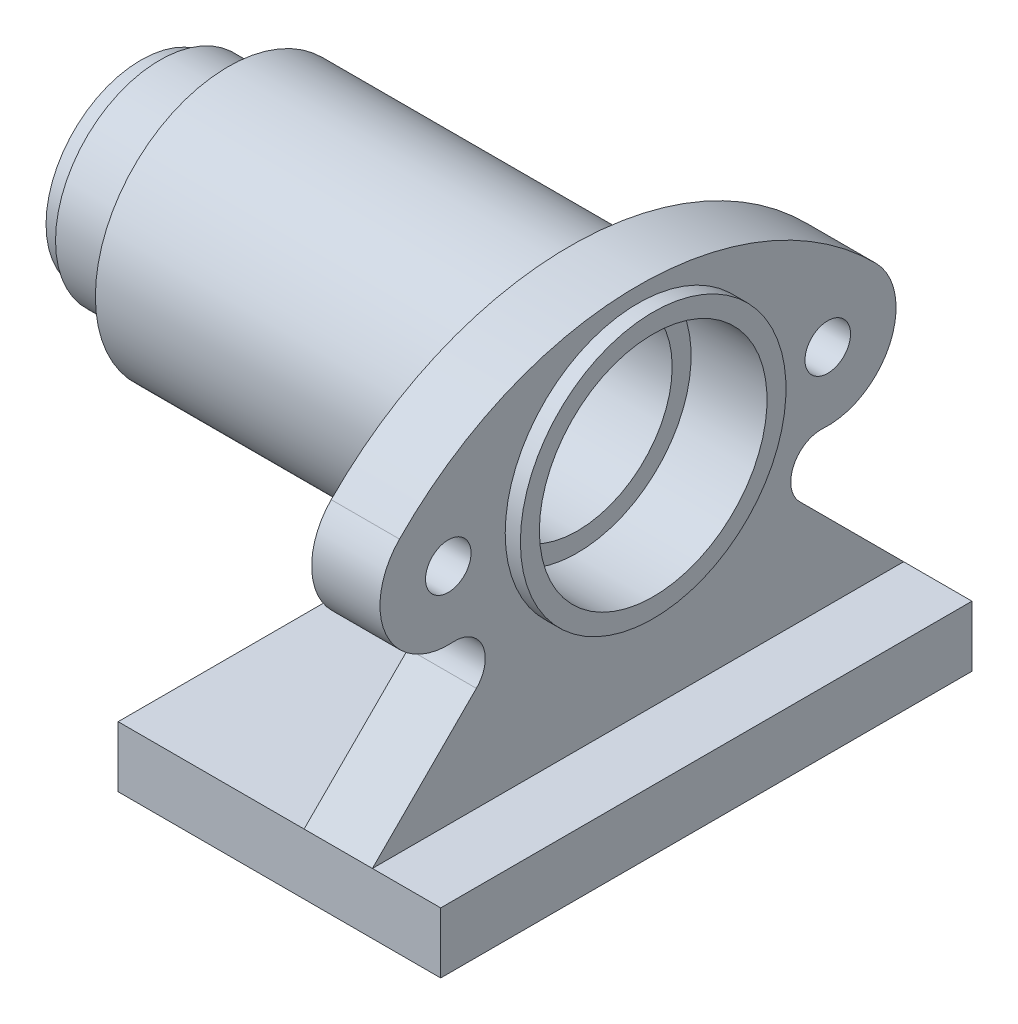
from build123d import *

# Parameters (mm, degrees)
SKETCH_1_W      = 85
SKETCH_1_H      = 16
EXTRUDE_2_DEPTH = 70
SKETCH_3_R      = 6
SKETCH_3_R_2    = 35
EXTRUDE_3_DEPTH = 18


with BuildPart() as part:
    # Sketch 1 → Extrude 2 (new, symmetric)
    with BuildSketch(Plane.XY):
        with Locations((-42.5, 8)):
            Rectangle(SKETCH_1_W, SKETCH_1_H)
    extrude(amount=EXTRUDE_2_DEPTH, both=True)



with BuildPart() as body_2:
    # Sketch 2 → Revolve 2 (revolve)
    with BuildSketch(Plane.XY, mode=Mode.PRIVATE) as revolve_2_sk:
        Polygon((-149, 91), (-149, 100), (-144, 100), (-144, 102.5), (-126, 102.5), (-126, 110), (-14, 110), (-14, 105), (-34, 105), (-34, 100), (-114, 100), (-114, 91), align=None)
    revolve(revolve_2_sk.sketch.rotate(Axis((-107.067924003, 75, 0), (1, 0, 0)), 90), axis=Axis((-107.067924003, 75, 0), (1, 0, 0)))


with BuildPart() as part_1:
    add(part.part)

    add(body_2.part)  # Extrude 3 merges body 2
    # Sketch 3 → Extrude 3 (add)
    with BuildSketch(Plane(origin=(-18, 0, 0), x_dir=(0, 0, -1), z_dir=(1, 0, 0))):
        with BuildLine():
            Line((-70, 16), (-42.598236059, 43.401763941))
            ThreePointArc((-42.598236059, 43.401763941), (-40.971009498, 52.366512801), (-48.791985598, 57.040581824))
            ThreePointArc((-48.791985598, 57.040581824), (-66.35099273, 67.473710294), (-62.857142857, 87.59737582))
            ThreePointArc((-62.857142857, 87.59737582), (0, 114.010205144), (62.857142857, 87.59737582))
            ThreePointArc((62.857142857, 87.59737582), (66.35099273, 67.473710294), (48.791985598, 57.040581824))
            ThreePointArc((48.791985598, 57.040581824), (40.971009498, 52.366512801), (42.598236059, 43.401763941))
            Line((42.598236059, 43.401763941), (70, 16))
            Line((70, 16), (-70, 16))
        make_face()
        with Locations((-50, 75)):
            Circle(SKETCH_3_R, mode=Mode.SUBTRACT)
        with Locations(Location((50, 75, 0), (0, 0, 180))):
            Circle(SKETCH_3_R, mode=Mode.SUBTRACT)
        with Locations(Location((0, 75, 0), (0, 0, 180))):
            Circle(SKETCH_3_R_2, mode=Mode.SUBTRACT)
    extrude(amount=-EXTRUDE_3_DEPTH)


solid = part_1.part
